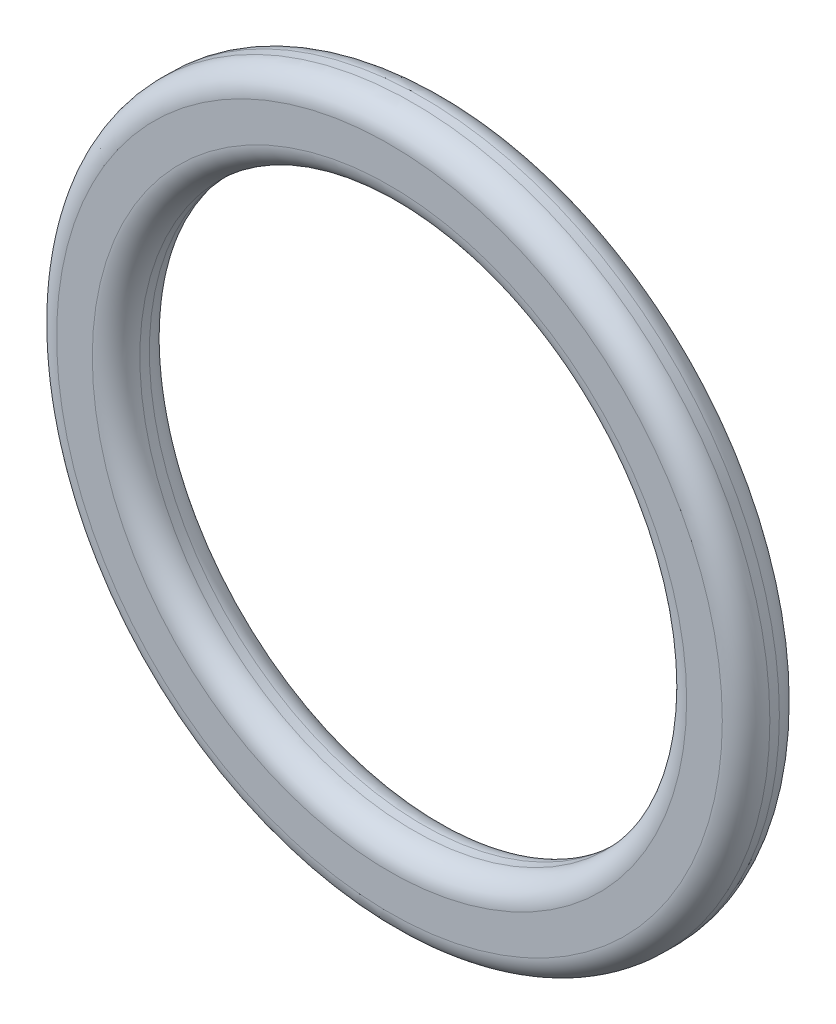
from build123d import *


with BuildPart() as part:
    # Esquisse1 → R_volution1 (revolve)
    with BuildSketch(Plane(origin=(0, 0, 0), x_dir=(0, 0, -1), z_dir=(1, 0, 0)), mode=Mode.PRIVATE) as r_volution1_sk:
        with BuildLine():
            Line((1.459361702, 15), (1.859361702, 15))
            ThreePointArc((1.859361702, 15), (2.566468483, 14.707106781), (2.859361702, 14))
            Line((2.859361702, 14), (2.859361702, 12.5))
            ThreePointArc((2.859361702, 12.5), (2.566468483, 11.792893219), (1.859361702, 11.5))
            Line((1.859361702, 11.5), (1.459361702, 11.5))
            ThreePointArc((1.459361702, 11.5), (0.752254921, 11.792893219), (0.459361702, 12.5))
            Line((0.459361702, 12.5), (0.459361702, 14))
            ThreePointArc((0.459361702, 14), (0.752254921, 14.707106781), (1.459361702, 15))
        make_face()
    revolve(r_volution1_sk.sketch.rotate(Axis((0, 0, 20.824397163), (0, 0, -1)), 90), axis=Axis((0, 0, 20.824397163), (0, 0, -1)))


solid = part.part
